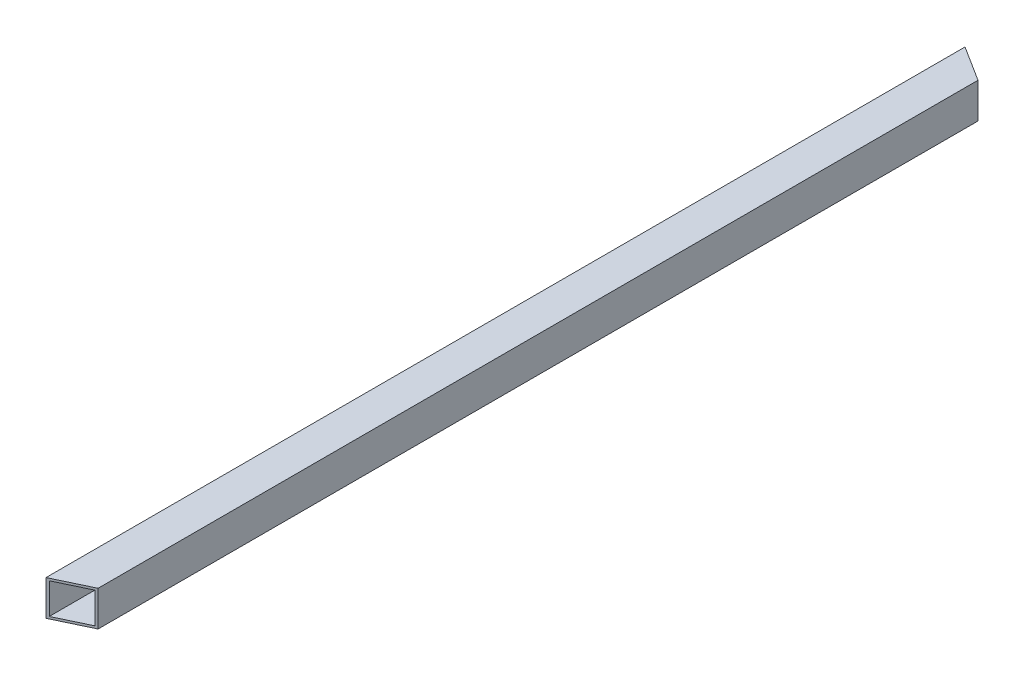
from build123d import *

# Parameters (mm, degrees)
SKETCH1_W          = 50.8
SKETCH1_H          = 50.8
SKETCH1_W_2        = 44.45
SKETCH1_H_2        = 44.45
EXTRUDE1_DEPTH     = 2677.0203
EXTRUDE2_DEPTH     = 2678.984123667
CUT_EXTRUDE1_DEPTH = 2678.984123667


with BuildPart() as part:
    # Sketch1 → Extrude1 (new body)
    with BuildSketch(Plane.XY):
        with Locations((25.4, 25.4)):
            Rectangle(SKETCH1_W, SKETCH1_H)
        with Locations((25.4, 25.4)):
            Rectangle(SKETCH1_W_2, SKETCH1_H_2, mode=Mode.SUBTRACT)
    extrude(amount=EXTRUDE1_DEPTH)

    # Sketch2 → Extrude2 (cut, through all)
    with BuildSketch(Plane.XZ):
        Polygon((-62.49547155, 2677.0203), (-62.49547155, 2605.412868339), (50.8, 2677.0203), align=None)
        Polygon((160.00309794, 101.128586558), (160.00309794, 0), (0, 0), align=None)
    extrude(amount=-EXTRUDE2_DEPTH, mode=Mode.SUBTRACT)

    # Sketch4 → Cut-Extrude1 (cut, through all)
    with BuildSketch(Plane(origin=(0, 50.8, 0), x_dir=(1, 0, 0), z_dir=(0, 1, 0))):
        Polygon((148.511746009, -1251.561852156), (148.511746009, -2692.354593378), (-37.520437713, -2692.354593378), (-37.520437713, -1339.939542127), align=None)
    extrude(amount=-CUT_EXTRUDE1_DEPTH, mode=Mode.SUBTRACT)


solid = part.part
